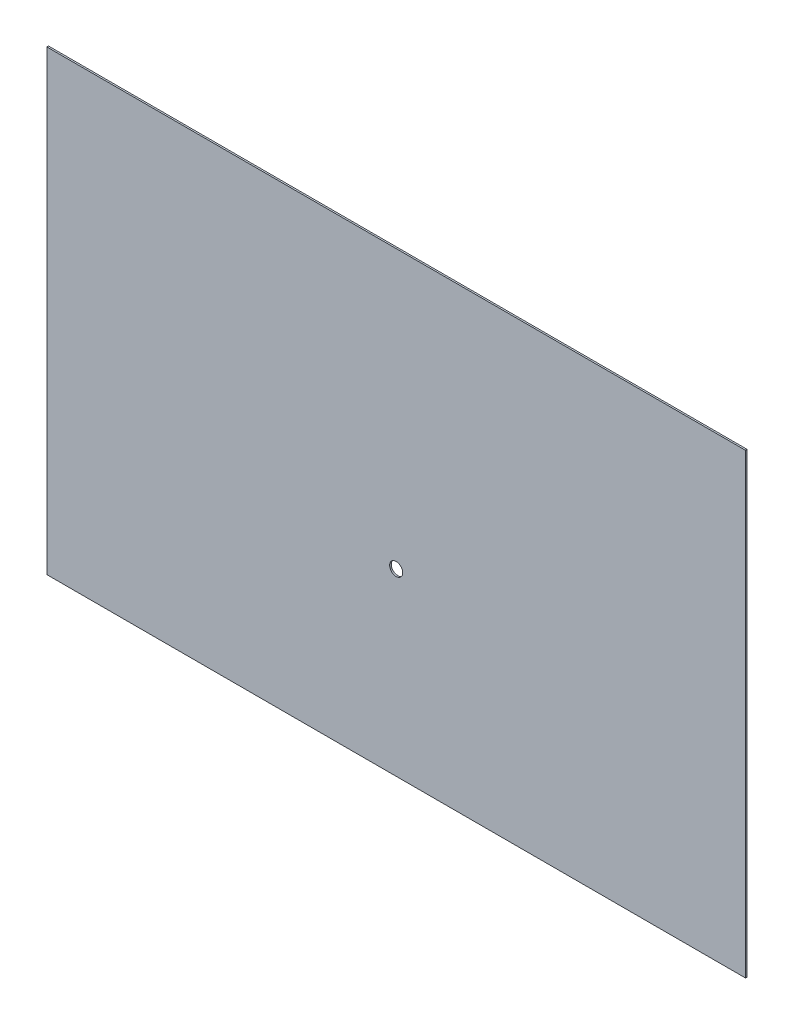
ISO-10303-21;
HEADER;
FILE_DESCRIPTION(('STEP AP214'),'2;1');
FILE_NAME('part.step','',(''),(''),'','','');
FILE_SCHEMA(('AUTOMOTIVE_DESIGN { 1 0 10303 214 1 1 1 1 }'));
ENDSEC;
DATA;
#1=APPLICATION_CONTEXT('core data for automotive mechanical design processes');
#2=APPLICATION_PROTOCOL_DEFINITION('international standard','automotive_design',2000,#1);
#3=PRODUCT_CONTEXT('',#1,'mechanical');
#4=PRODUCT('Part','Part','',(#3));
#5=PRODUCT_RELATED_PRODUCT_CATEGORY('part','',(#4));
#6=PRODUCT_DEFINITION_FORMATION('','',#4);
#7=PRODUCT_DEFINITION_CONTEXT('part definition',#1,'design');
#8=PRODUCT_DEFINITION('design','',#6,#7);
#9=PRODUCT_DEFINITION_SHAPE('','',#8);
#10=(LENGTH_UNIT() NAMED_UNIT(*) SI_UNIT(.MILLI.,.METRE.));
#11=(NAMED_UNIT(*) PLANE_ANGLE_UNIT() SI_UNIT($,.RADIAN.));
#12=(NAMED_UNIT(*) SI_UNIT($,.STERADIAN.) SOLID_ANGLE_UNIT());
#13=UNCERTAINTY_MEASURE_WITH_UNIT(LENGTH_MEASURE(1.E-05),#10,'distance_accuracy_value','');
#14=(GEOMETRIC_REPRESENTATION_CONTEXT(3) GLOBAL_UNCERTAINTY_ASSIGNED_CONTEXT((#13)) GLOBAL_UNIT_ASSIGNED_CONTEXT((#10,
#11,#12)) REPRESENTATION_CONTEXT('',''));
#15=CARTESIAN_POINT('',(0.,0.,0.));
#16=DIRECTION('',(0.,0.,1.));
#17=DIRECTION('',(1.,0.,0.));
#18=AXIS2_PLACEMENT_3D('',#15,#16,#17);
#19=CARTESIAN_POINT('',(0.,280.,1.));
#20=DIRECTION('',(0.,0.,-1.));
#21=DIRECTION('',(-1.,0.,0.));
#22=AXIS2_PLACEMENT_3D('',#19,#20,#21);
#23=PLANE('',#22);
#24=DIRECTION('',(0.,-1.,0.));
#25=VECTOR('',#24,1.);
#26=CARTESIAN_POINT('',(0.,0.,1.));
#27=LINE('',#26,#25);
#28=CARTESIAN_POINT('',(0.,280.,1.));
#29=VERTEX_POINT('',#28);
#30=CARTESIAN_POINT('',(0.,0.,1.));
#31=VERTEX_POINT('',#30);
#32=EDGE_CURVE('E83',#29,#31,#27,.T.);
#33=ORIENTED_EDGE('',*,*,#32,.T.);
#34=DIRECTION('',(1.,0.,0.));
#35=VECTOR('',#34,1.);
#36=CARTESIAN_POINT('',(0.,0.,1.));
#37=LINE('',#36,#35);
#38=CARTESIAN_POINT('',(428.,0.,1.));
#39=VERTEX_POINT('',#38);
#40=EDGE_CURVE('E78',#31,#39,#37,.T.);
#41=ORIENTED_EDGE('',*,*,#40,.T.);
#42=DIRECTION('',(0.,1.,0.));
#43=VECTOR('',#42,1.);
#44=CARTESIAN_POINT('',(428.,0.,1.));
#45=LINE('',#44,#43);
#46=CARTESIAN_POINT('',(428.,280.,1.));
#47=VERTEX_POINT('',#46);
#48=EDGE_CURVE('E81',#39,#47,#45,.T.);
#49=ORIENTED_EDGE('',*,*,#48,.T.);
#50=DIRECTION('',(-1.,0.,0.));
#51=VECTOR('',#50,1.);
#52=CARTESIAN_POINT('',(0.,280.,1.));
#53=LINE('',#52,#51);
#54=EDGE_CURVE('E48',#47,#29,#53,.T.);
#55=ORIENTED_EDGE('',*,*,#54,.T.);
#56=EDGE_LOOP('',(#33,#41,#49,#55));
#57=FACE_BOUND('',#56,.T.);
#58=CARTESIAN_POINT('',(214.,110.,1.));
#59=DIRECTION('',(0.,0.,1.));
#60=DIRECTION('',(1.,0.,0.));
#61=AXIS2_PLACEMENT_3D('',#58,#59,#60);
#62=CIRCLE('',#61,3.99999999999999);
#63=CARTESIAN_POINT('',(218.,110.,1.));
#64=VERTEX_POINT('',#63);
#65=EDGE_CURVE('E98',#64,#64,#62,.T.);
#66=ORIENTED_EDGE('',*,*,#65,.F.);
#67=EDGE_LOOP('',(#66));
#68=FACE_BOUND('',#67,.T.);
#69=ADVANCED_FACE('F31',(#57,#68),#23,.F.);
#70=CARTESIAN_POINT('',(0.,280.,0.));
#71=DIRECTION('',(0.,0.,-1.));
#72=DIRECTION('',(-1.,0.,0.));
#73=AXIS2_PLACEMENT_3D('',#70,#71,#72);
#74=PLANE('',#73);
#75=DIRECTION('',(0.,-1.,0.));
#76=VECTOR('',#75,1.);
#77=CARTESIAN_POINT('',(0.,0.,0.));
#78=LINE('',#77,#76);
#79=CARTESIAN_POINT('',(0.,280.,0.));
#80=VERTEX_POINT('',#79);
#81=CARTESIAN_POINT('',(0.,0.,0.));
#82=VERTEX_POINT('',#81);
#83=EDGE_CURVE('E95',#80,#82,#78,.T.);
#84=ORIENTED_EDGE('',*,*,#83,.F.);
#85=DIRECTION('',(-1.,0.,0.));
#86=VECTOR('',#85,1.);
#87=CARTESIAN_POINT('',(0.,280.,0.));
#88=LINE('',#87,#86);
#89=CARTESIAN_POINT('',(428.,280.,0.));
#90=VERTEX_POINT('',#89);
#91=EDGE_CURVE('E71',#90,#80,#88,.T.);
#92=ORIENTED_EDGE('',*,*,#91,.F.);
#93=DIRECTION('',(0.,1.,0.));
#94=VECTOR('',#93,1.);
#95=CARTESIAN_POINT('',(428.,0.,0.));
#96=LINE('',#95,#94);
#97=CARTESIAN_POINT('',(428.,0.,0.));
#98=VERTEX_POINT('',#97);
#99=EDGE_CURVE('E65',#98,#90,#96,.T.);
#100=ORIENTED_EDGE('',*,*,#99,.F.);
#101=DIRECTION('',(1.,0.,0.));
#102=VECTOR('',#101,1.);
#103=CARTESIAN_POINT('',(0.,0.,0.));
#104=LINE('',#103,#102);
#105=EDGE_CURVE('E87',#82,#98,#104,.T.);
#106=ORIENTED_EDGE('',*,*,#105,.F.);
#107=EDGE_LOOP('',(#84,#92,#100,#106));
#108=FACE_BOUND('',#107,.T.);
#109=CARTESIAN_POINT('',(214.,110.,0.));
#110=DIRECTION('',(0.,0.,1.));
#111=DIRECTION('',(1.,0.,0.));
#112=AXIS2_PLACEMENT_3D('',#109,#110,#111);
#113=CIRCLE('',#112,3.99999999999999);
#114=CARTESIAN_POINT('',(218.,110.,0.));
#115=VERTEX_POINT('',#114);
#116=EDGE_CURVE('E110',#115,#115,#113,.T.);
#117=ORIENTED_EDGE('',*,*,#116,.T.);
#118=EDGE_LOOP('',(#117));
#119=FACE_BOUND('',#118,.T.);
#120=ADVANCED_FACE('F106',(#108,#119),#74,.T.);
#121=CARTESIAN_POINT('',(0.,0.,1.));
#122=DIRECTION('',(1.,0.,0.));
#123=DIRECTION('',(0.,0.,-1.));
#124=AXIS2_PLACEMENT_3D('',#121,#122,#123);
#125=PLANE('',#124);
#126=ORIENTED_EDGE('',*,*,#83,.T.);
#127=DIRECTION('',(0.,0.,-1.));
#128=VECTOR('',#127,1.);
#129=CARTESIAN_POINT('',(0.,0.,1.));
#130=LINE('',#129,#128);
#131=EDGE_CURVE('E11',#31,#82,#130,.T.);
#132=ORIENTED_EDGE('',*,*,#131,.F.);
#133=ORIENTED_EDGE('',*,*,#32,.F.);
#134=DIRECTION('',(0.,0.,-1.));
#135=VECTOR('',#134,1.);
#136=CARTESIAN_POINT('',(0.,280.,1.));
#137=LINE('',#136,#135);
#138=EDGE_CURVE('E91',#29,#80,#137,.T.);
#139=ORIENTED_EDGE('',*,*,#138,.T.);
#140=EDGE_LOOP('',(#126,#132,#133,#139));
#141=FACE_BOUND('',#140,.T.);
#142=ADVANCED_FACE('F33',(#141),#125,.F.);
#143=CARTESIAN_POINT('',(0.,0.,1.));
#144=DIRECTION('',(0.,1.,0.));
#145=DIRECTION('',(0.,0.,1.));
#146=AXIS2_PLACEMENT_3D('',#143,#144,#145);
#147=PLANE('',#146);
#148=ORIENTED_EDGE('',*,*,#105,.T.);
#149=DIRECTION('',(0.,0.,-1.));
#150=VECTOR('',#149,1.);
#151=CARTESIAN_POINT('',(428.,0.,1.));
#152=LINE('',#151,#150);
#153=EDGE_CURVE('E40',#39,#98,#152,.T.);
#154=ORIENTED_EDGE('',*,*,#153,.F.);
#155=ORIENTED_EDGE('',*,*,#40,.F.);
#156=ORIENTED_EDGE('',*,*,#131,.T.);
#157=EDGE_LOOP('',(#148,#154,#155,#156));
#158=FACE_BOUND('',#157,.T.);
#159=ADVANCED_FACE('F86',(#158),#147,.F.);
#160=CARTESIAN_POINT('',(428.,0.,1.));
#161=DIRECTION('',(-1.,0.,0.));
#162=DIRECTION('',(0.,0.,1.));
#163=AXIS2_PLACEMENT_3D('',#160,#161,#162);
#164=PLANE('',#163);
#165=ORIENTED_EDGE('',*,*,#99,.T.);
#166=DIRECTION('',(0.,0.,-1.));
#167=VECTOR('',#166,1.);
#168=CARTESIAN_POINT('',(428.,280.,1.));
#169=LINE('',#168,#167);
#170=EDGE_CURVE('E88',#47,#90,#169,.T.);
#171=ORIENTED_EDGE('',*,*,#170,.F.);
#172=ORIENTED_EDGE('',*,*,#48,.F.);
#173=ORIENTED_EDGE('',*,*,#153,.T.);
#174=EDGE_LOOP('',(#165,#171,#172,#173));
#175=FACE_BOUND('',#174,.T.);
#176=ADVANCED_FACE('F89',(#175),#164,.F.);
#177=CARTESIAN_POINT('',(0.,280.,1.));
#178=DIRECTION('',(0.,-1.,0.));
#179=DIRECTION('',(0.,0.,-1.));
#180=AXIS2_PLACEMENT_3D('',#177,#178,#179);
#181=PLANE('',#180);
#182=ORIENTED_EDGE('',*,*,#91,.T.);
#183=ORIENTED_EDGE('',*,*,#138,.F.);
#184=ORIENTED_EDGE('',*,*,#54,.F.);
#185=ORIENTED_EDGE('',*,*,#170,.T.);
#186=EDGE_LOOP('',(#182,#183,#184,#185));
#187=FACE_BOUND('',#186,.T.);
#188=ADVANCED_FACE('F103',(#187),#181,.F.);
#189=CARTESIAN_POINT('',(214.,110.,1.));
#190=DIRECTION('',(0.,0.,-1.));
#191=DIRECTION('',(-1.,0.,0.));
#192=AXIS2_PLACEMENT_3D('',#189,#190,#191);
#193=CYLINDRICAL_SURFACE('',#192,3.99999999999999);
#194=ORIENTED_EDGE('',*,*,#65,.T.);
#195=EDGE_LOOP('',(#194));
#196=FACE_BOUND('',#195,.T.);
#197=ORIENTED_EDGE('',*,*,#116,.F.);
#198=EDGE_LOOP('',(#197));
#199=FACE_BOUND('',#198,.T.);
#200=ADVANCED_FACE('F116',(#196,#199),#193,.F.);
#201=CLOSED_SHELL('',(#69,#120,#142,#159,#176,#188,#200));
#202=MANIFOLD_SOLID_BREP('B2',#201);
#203=ADVANCED_BREP_SHAPE_REPRESENTATION('',(#18,#202),#14);
#204=SHAPE_DEFINITION_REPRESENTATION(#9,#203);
ENDSEC;
END-ISO-10303-21;
